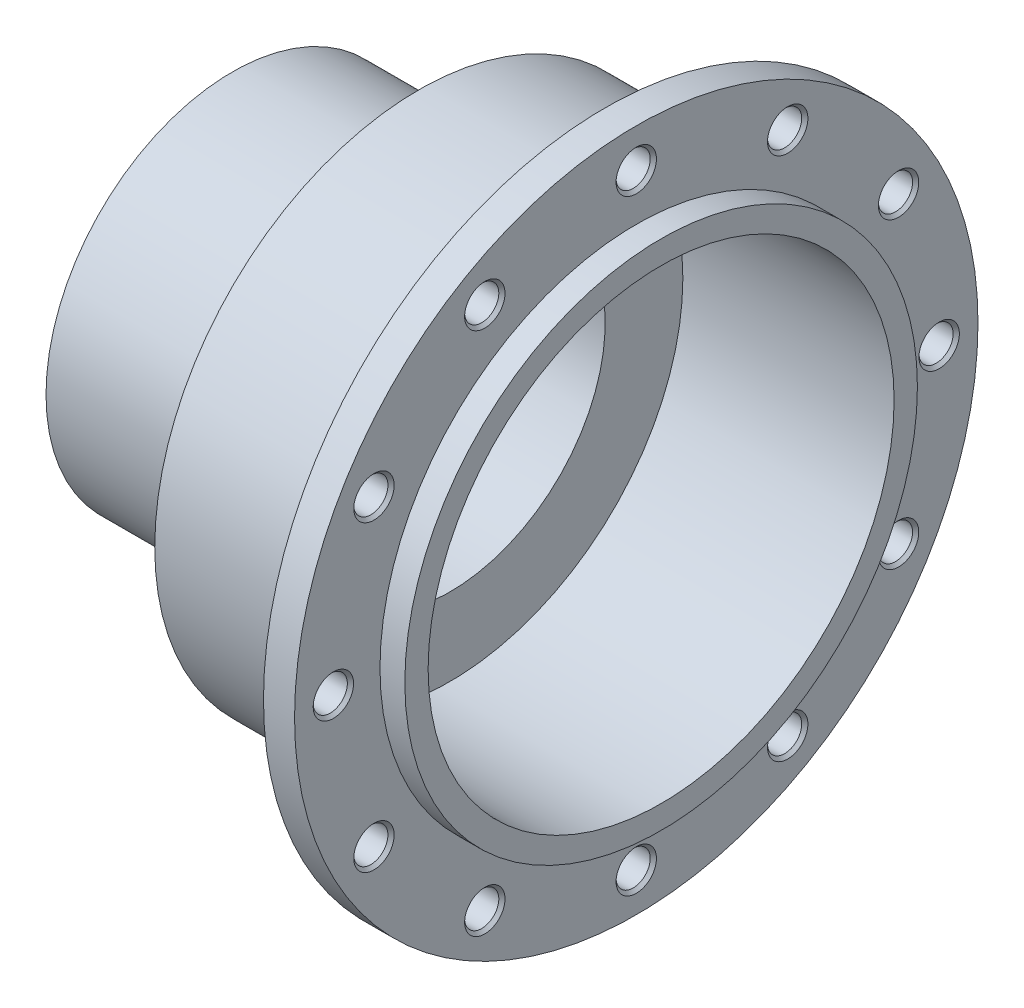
ISO-10303-21;
HEADER;
FILE_DESCRIPTION(('STEP AP214'),'2;1');
FILE_NAME('part.step','',(''),(''),'','','');
FILE_SCHEMA(('AUTOMOTIVE_DESIGN { 1 0 10303 214 1 1 1 1 }'));
ENDSEC;
DATA;
#1=APPLICATION_CONTEXT('core data for automotive mechanical design processes');
#2=APPLICATION_PROTOCOL_DEFINITION('international standard','automotive_design',2000,#1);
#3=PRODUCT_CONTEXT('',#1,'mechanical');
#4=PRODUCT('Part','Part','',(#3));
#5=PRODUCT_RELATED_PRODUCT_CATEGORY('part','',(#4));
#6=PRODUCT_DEFINITION_FORMATION('','',#4);
#7=PRODUCT_DEFINITION_CONTEXT('part definition',#1,'design');
#8=PRODUCT_DEFINITION('design','',#6,#7);
#9=PRODUCT_DEFINITION_SHAPE('','',#8);
#10=(LENGTH_UNIT() NAMED_UNIT(*) SI_UNIT(.MILLI.,.METRE.));
#11=(NAMED_UNIT(*) PLANE_ANGLE_UNIT() SI_UNIT($,.RADIAN.));
#12=(NAMED_UNIT(*) SI_UNIT($,.STERADIAN.) SOLID_ANGLE_UNIT());
#13=UNCERTAINTY_MEASURE_WITH_UNIT(LENGTH_MEASURE(1.E-05),#10,'distance_accuracy_value','');
#14=(GEOMETRIC_REPRESENTATION_CONTEXT(3) GLOBAL_UNCERTAINTY_ASSIGNED_CONTEXT((#13)) GLOBAL_UNIT_ASSIGNED_CONTEXT((#10,
#11,#12)) REPRESENTATION_CONTEXT('',''));
#15=CARTESIAN_POINT('',(0.,0.,0.));
#16=DIRECTION('',(0.,0.,1.));
#17=DIRECTION('',(1.,0.,0.));
#18=AXIS2_PLACEMENT_3D('',#15,#16,#17);
#19=CARTESIAN_POINT('',(10.,30.,0.));
#20=DIRECTION('',(-1.,0.,0.));
#21=DIRECTION('',(0.,0.,1.));
#22=AXIS2_PLACEMENT_3D('',#19,#20,#21);
#23=PLANE('',#22);
#24=CARTESIAN_POINT('',(10.,0.,0.));
#25=DIRECTION('',(-1.,0.,0.));
#26=DIRECTION('',(0.,0.,1.));
#27=AXIS2_PLACEMENT_3D('',#24,#25,#26);
#28=CIRCLE('',#27,14.5);
#29=CARTESIAN_POINT('',(10.,0.,14.5));
#30=VERTEX_POINT('',#29);
#31=EDGE_CURVE('E47',#30,#30,#28,.F.);
#32=ORIENTED_EDGE('',*,*,#31,.T.);
#33=EDGE_LOOP('',(#32));
#34=FACE_BOUND('',#33,.T.);
#35=CARTESIAN_POINT('',(10.,0.,0.));
#36=DIRECTION('',(-1.,0.,0.));
#37=DIRECTION('',(0.,0.,1.));
#38=AXIS2_PLACEMENT_3D('',#35,#36,#37);
#39=CIRCLE('',#38,12.75);
#40=CARTESIAN_POINT('',(10.,0.,12.75));
#41=VERTEX_POINT('',#40);
#42=EDGE_CURVE('E237',#41,#41,#39,.T.);
#43=ORIENTED_EDGE('',*,*,#42,.T.);
#44=EDGE_LOOP('',(#43));
#45=FACE_BOUND('',#44,.T.);
#46=ADVANCED_FACE('F39',(#34,#45),#23,.F.);
#47=CARTESIAN_POINT('',(130.,110.,0.));
#48=DIRECTION('',(-1.,0.,0.));
#49=DIRECTION('',(0.,0.,1.));
#50=AXIS2_PLACEMENT_3D('',#47,#48,#49);
#51=PLANE('',#50);
#52=CARTESIAN_POINT('',(130.,0.,0.));
#53=DIRECTION('',(-1.,0.,0.));
#54=DIRECTION('',(0.,0.,1.));
#55=AXIS2_PLACEMENT_3D('',#52,#53,#54);
#56=CIRCLE('',#55,110.);
#57=CARTESIAN_POINT('',(130.,0.,110.));
#58=VERTEX_POINT('',#57);
#59=EDGE_CURVE('E219',#58,#58,#56,.T.);
#60=ORIENTED_EDGE('',*,*,#59,.F.);
#61=EDGE_LOOP('',(#60));
#62=FACE_BOUND('',#61,.T.);
#63=CARTESIAN_POINT('',(130.,97.5,0.));
#64=DIRECTION('',(-1.,0.,0.));
#65=DIRECTION('',(0.,0.,1.));
#66=AXIS2_PLACEMENT_3D('',#63,#64,#65);
#67=CIRCLE('',#66,6.49999999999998);
#68=CARTESIAN_POINT('',(130.,97.5,6.49999999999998));
#69=VERTEX_POINT('',#68);
#70=EDGE_CURVE('E189',#69,#69,#67,.T.);
#71=ORIENTED_EDGE('',*,*,#70,.T.);
#72=EDGE_LOOP('',(#71));
#73=FACE_BOUND('',#72,.T.);
#74=CARTESIAN_POINT('',(130.,84.4374768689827,48.7500000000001));
#75=DIRECTION('',(-1.,0.,0.));
#76=DIRECTION('',(0.,0.,1.));
#77=AXIS2_PLACEMENT_3D('',#74,#75,#76);
#78=CIRCLE('',#77,6.50000000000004);
#79=CARTESIAN_POINT('',(130.,84.4374768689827,55.2500000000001));
#80=VERTEX_POINT('',#79);
#81=EDGE_CURVE('E177',#80,#80,#78,.T.);
#82=ORIENTED_EDGE('',*,*,#81,.T.);
#83=EDGE_LOOP('',(#82));
#84=FACE_BOUND('',#83,.T.);
#85=CARTESIAN_POINT('',(130.,48.7499999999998,84.4374768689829));
#86=DIRECTION('',(-1.,0.,0.));
#87=DIRECTION('',(0.,0.,1.));
#88=AXIS2_PLACEMENT_3D('',#85,#86,#87);
#89=CIRCLE('',#88,6.49999999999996);
#90=CARTESIAN_POINT('',(130.,48.7499999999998,90.9374768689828));
#91=VERTEX_POINT('',#90);
#92=EDGE_CURVE('E165',#91,#91,#89,.T.);
#93=ORIENTED_EDGE('',*,*,#92,.T.);
#94=EDGE_LOOP('',(#93));
#95=FACE_BOUND('',#94,.T.);
#96=CARTESIAN_POINT('',(130.,-3.40725592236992E-13,97.5));
#97=DIRECTION('',(-1.,0.,0.));
#98=DIRECTION('',(0.,0.,1.));
#99=AXIS2_PLACEMENT_3D('',#96,#97,#98);
#100=CIRCLE('',#99,6.49999999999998);
#101=CARTESIAN_POINT('',(130.,-3.40725592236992E-13,104.));
#102=VERTEX_POINT('',#101);
#103=EDGE_CURVE('E153',#102,#102,#100,.T.);
#104=ORIENTED_EDGE('',*,*,#103,.T.);
#105=EDGE_LOOP('',(#104));
#106=FACE_BOUND('',#105,.T.);
#107=CARTESIAN_POINT('',(130.,-48.7500000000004,84.4374768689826));
#108=DIRECTION('',(-1.,0.,0.));
#109=DIRECTION('',(0.,0.,1.));
#110=AXIS2_PLACEMENT_3D('',#107,#108,#109);
#111=CIRCLE('',#110,6.49999999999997);
#112=CARTESIAN_POINT('',(130.,-48.7500000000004,90.9374768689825));
#113=VERTEX_POINT('',#112);
#114=EDGE_CURVE('E141',#113,#113,#111,.T.);
#115=ORIENTED_EDGE('',*,*,#114,.T.);
#116=EDGE_LOOP('',(#115));
#117=FACE_BOUND('',#116,.T.);
#118=CARTESIAN_POINT('',(130.,-84.4374768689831,48.7499999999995));
#119=DIRECTION('',(-1.,0.,0.));
#120=DIRECTION('',(0.,0.,1.));
#121=AXIS2_PLACEMENT_3D('',#118,#119,#120);
#122=CIRCLE('',#121,6.49999999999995);
#123=CARTESIAN_POINT('',(130.,-84.4374768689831,55.2499999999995));
#124=VERTEX_POINT('',#123);
#125=EDGE_CURVE('E129',#124,#124,#122,.T.);
#126=ORIENTED_EDGE('',*,*,#125,.T.);
#127=EDGE_LOOP('',(#126));
#128=FACE_BOUND('',#127,.T.);
#129=CARTESIAN_POINT('',(130.,-97.5,0.));
#130=DIRECTION('',(-1.,0.,0.));
#131=DIRECTION('',(0.,0.,1.));
#132=AXIS2_PLACEMENT_3D('',#129,#130,#131);
#133=CIRCLE('',#132,6.49999999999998);
#134=CARTESIAN_POINT('',(130.,-97.5,6.49999999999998));
#135=VERTEX_POINT('',#134);
#136=EDGE_CURVE('E117',#135,#135,#133,.T.);
#137=ORIENTED_EDGE('',*,*,#136,.T.);
#138=EDGE_LOOP('',(#137));
#139=FACE_BOUND('',#138,.T.);
#140=CARTESIAN_POINT('',(130.,-84.4374768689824,-48.7500000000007));
#141=DIRECTION('',(-1.,0.,0.));
#142=DIRECTION('',(0.,0.,1.));
#143=AXIS2_PLACEMENT_3D('',#140,#141,#142);
#144=CIRCLE('',#143,6.49999999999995);
#145=CARTESIAN_POINT('',(130.,-84.4374768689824,-42.2500000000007));
#146=VERTEX_POINT('',#145);
#147=EDGE_CURVE('E105',#146,#146,#144,.T.);
#148=ORIENTED_EDGE('',*,*,#147,.T.);
#149=EDGE_LOOP('',(#148));
#150=FACE_BOUND('',#149,.T.);
#151=CARTESIAN_POINT('',(130.,-48.7499999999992,-84.4374768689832));
#152=DIRECTION('',(-1.,0.,0.));
#153=DIRECTION('',(0.,0.,1.));
#154=AXIS2_PLACEMENT_3D('',#151,#152,#153);
#155=CIRCLE('',#154,6.50000000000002);
#156=CARTESIAN_POINT('',(130.,-48.7499999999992,-77.9374768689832));
#157=VERTEX_POINT('',#156);
#158=EDGE_CURVE('E93',#157,#157,#155,.T.);
#159=ORIENTED_EDGE('',*,*,#158,.T.);
#160=EDGE_LOOP('',(#159));
#161=FACE_BOUND('',#160,.T.);
#162=CARTESIAN_POINT('',(130.,1.0215644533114E-12,-97.5));
#163=DIRECTION('',(-1.,0.,0.));
#164=DIRECTION('',(0.,0.,1.));
#165=AXIS2_PLACEMENT_3D('',#162,#163,#164);
#166=CIRCLE('',#165,6.49999999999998);
#167=CARTESIAN_POINT('',(130.,1.0215644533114E-12,-91.));
#168=VERTEX_POINT('',#167);
#169=EDGE_CURVE('E81',#168,#168,#166,.T.);
#170=ORIENTED_EDGE('',*,*,#169,.T.);
#171=EDGE_LOOP('',(#170));
#172=FACE_BOUND('',#171,.T.);
#173=CARTESIAN_POINT('',(130.,48.750000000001,-84.4374768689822));
#174=DIRECTION('',(-1.,0.,0.));
#175=DIRECTION('',(0.,0.,1.));
#176=AXIS2_PLACEMENT_3D('',#173,#174,#175);
#177=CIRCLE('',#176,6.49999999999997);
#178=CARTESIAN_POINT('',(130.,48.750000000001,-77.9374768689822));
#179=VERTEX_POINT('',#178);
#180=EDGE_CURVE('E69',#179,#179,#177,.T.);
#181=ORIENTED_EDGE('',*,*,#180,.T.);
#182=EDGE_LOOP('',(#181));
#183=FACE_BOUND('',#182,.T.);
#184=CARTESIAN_POINT('',(130.,84.4374768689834,-48.7499999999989));
#185=DIRECTION('',(-1.,0.,0.));
#186=DIRECTION('',(0.,0.,1.));
#187=AXIS2_PLACEMENT_3D('',#184,#185,#186);
#188=CIRCLE('',#187,6.50000000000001);
#189=CARTESIAN_POINT('',(130.,84.4374768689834,-42.2499999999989));
#190=VERTEX_POINT('',#189);
#191=EDGE_CURVE('E55',#190,#190,#188,.T.);
#192=ORIENTED_EDGE('',*,*,#191,.T.);
#193=EDGE_LOOP('',(#192));
#194=FACE_BOUND('',#193,.T.);
#195=CARTESIAN_POINT('',(130.,0.,0.));
#196=DIRECTION('',(-1.,0.,0.));
#197=DIRECTION('',(0.,0.,1.));
#198=AXIS2_PLACEMENT_3D('',#195,#196,#197);
#199=CIRCLE('',#198,82.5);
#200=CARTESIAN_POINT('',(130.,0.,82.5));
#201=VERTEX_POINT('',#200);
#202=EDGE_CURVE('E51',#201,#201,#199,.F.);
#203=ORIENTED_EDGE('',*,*,#202,.F.);
#204=EDGE_LOOP('',(#203));
#205=FACE_BOUND('',#204,.T.);
#206=ADVANCED_FACE('F269',(#62,#73,#84,#95,#106,#117,#128,#139,#150,#161,#172,#183,#194,#205),
#51,.F.);
#207=CARTESIAN_POINT('',(0.,0.,0.));
#208=DIRECTION('',(-1.,0.,0.));
#209=DIRECTION('',(0.,0.,1.));
#210=AXIS2_PLACEMENT_3D('',#207,#208,#209);
#211=CYLINDRICAL_SURFACE('',#210,12.75);
#212=ORIENTED_EDGE('',*,*,#42,.F.);
#213=EDGE_LOOP('',(#212));
#214=FACE_BOUND('',#213,.T.);
#215=CARTESIAN_POINT('',(0.,0.,0.));
#216=DIRECTION('',(-1.,0.,0.));
#217=DIRECTION('',(0.,0.,1.));
#218=AXIS2_PLACEMENT_3D('',#215,#216,#217);
#219=CIRCLE('',#218,12.75);
#220=CARTESIAN_POINT('',(0.,0.,12.75));
#221=VERTEX_POINT('',#220);
#222=EDGE_CURVE('E201',#221,#221,#219,.T.);
#223=ORIENTED_EDGE('',*,*,#222,.T.);
#224=EDGE_LOOP('',(#223));
#225=FACE_BOUND('',#224,.T.);
#226=ADVANCED_FACE('F276',(#214,#225),#211,.F.);
#227=CARTESIAN_POINT('',(0.,12.75,0.));
#228=DIRECTION('',(1.,0.,0.));
#229=DIRECTION('',(0.,0.,-1.));
#230=AXIS2_PLACEMENT_3D('',#227,#228,#229);
#231=PLANE('',#230);
#232=ORIENTED_EDGE('',*,*,#222,.F.);
#233=EDGE_LOOP('',(#232));
#234=FACE_BOUND('',#233,.T.);
#235=CARTESIAN_POINT('',(0.,0.,0.));
#236=DIRECTION('',(-1.,0.,0.));
#237=DIRECTION('',(0.,0.,1.));
#238=AXIS2_PLACEMENT_3D('',#235,#236,#237);
#239=CIRCLE('',#238,60.);
#240=CARTESIAN_POINT('',(0.,0.,60.));
#241=VERTEX_POINT('',#240);
#242=EDGE_CURVE('E204',#241,#241,#239,.T.);
#243=ORIENTED_EDGE('',*,*,#242,.T.);
#244=EDGE_LOOP('',(#243));
#245=FACE_BOUND('',#244,.T.);
#246=ADVANCED_FACE('F333',(#234,#245),#231,.F.);
#247=CARTESIAN_POINT('',(0.,0.,0.));
#248=DIRECTION('',(-1.,0.,0.));
#249=DIRECTION('',(0.,0.,1.));
#250=AXIS2_PLACEMENT_3D('',#247,#248,#249);
#251=CYLINDRICAL_SURFACE('',#250,60.);
#252=ORIENTED_EDGE('',*,*,#242,.F.);
#253=EDGE_LOOP('',(#252));
#254=FACE_BOUND('',#253,.T.);
#255=CARTESIAN_POINT('',(60.,0.,0.));
#256=DIRECTION('',(-1.,0.,0.));
#257=DIRECTION('',(0.,0.,1.));
#258=AXIS2_PLACEMENT_3D('',#255,#256,#257);
#259=CIRCLE('',#258,60.);
#260=CARTESIAN_POINT('',(60.,0.,60.));
#261=VERTEX_POINT('',#260);
#262=EDGE_CURVE('E207',#261,#261,#259,.T.);
#263=ORIENTED_EDGE('',*,*,#262,.T.);
#264=EDGE_LOOP('',(#263));
#265=FACE_BOUND('',#264,.T.);
#266=ADVANCED_FACE('F329',(#254,#265),#251,.T.);
#267=CARTESIAN_POINT('',(60.,60.,0.));
#268=DIRECTION('',(1.,0.,0.));
#269=DIRECTION('',(0.,0.,-1.));
#270=AXIS2_PLACEMENT_3D('',#267,#268,#269);
#271=PLANE('',#270);
#272=ORIENTED_EDGE('',*,*,#262,.F.);
#273=EDGE_LOOP('',(#272));
#274=FACE_BOUND('',#273,.T.);
#275=CARTESIAN_POINT('',(60.,0.,0.));
#276=DIRECTION('',(-1.,0.,0.));
#277=DIRECTION('',(0.,0.,1.));
#278=AXIS2_PLACEMENT_3D('',#275,#276,#277);
#279=CIRCLE('',#278,85.);
#280=CARTESIAN_POINT('',(60.,0.,85.));
#281=VERTEX_POINT('',#280);
#282=EDGE_CURVE('E210',#281,#281,#279,.T.);
#283=ORIENTED_EDGE('',*,*,#282,.T.);
#284=EDGE_LOOP('',(#283));
#285=FACE_BOUND('',#284,.T.);
#286=ADVANCED_FACE('F325',(#274,#285),#271,.F.);
#287=CARTESIAN_POINT('',(0.,0.,0.));
#288=DIRECTION('',(-1.,0.,0.));
#289=DIRECTION('',(0.,0.,1.));
#290=AXIS2_PLACEMENT_3D('',#287,#288,#289);
#291=CYLINDRICAL_SURFACE('',#290,85.);
#292=ORIENTED_EDGE('',*,*,#282,.F.);
#293=EDGE_LOOP('',(#292));
#294=FACE_BOUND('',#293,.T.);
#295=CARTESIAN_POINT('',(120.,0.,0.));
#296=DIRECTION('',(-1.,0.,0.));
#297=DIRECTION('',(0.,0.,1.));
#298=AXIS2_PLACEMENT_3D('',#295,#296,#297);
#299=CIRCLE('',#298,85.);
#300=CARTESIAN_POINT('',(120.,0.,85.));
#301=VERTEX_POINT('',#300);
#302=EDGE_CURVE('E213',#301,#301,#299,.T.);
#303=ORIENTED_EDGE('',*,*,#302,.T.);
#304=EDGE_LOOP('',(#303));
#305=FACE_BOUND('',#304,.T.);
#306=ADVANCED_FACE('F321',(#294,#305),#291,.T.);
#307=CARTESIAN_POINT('',(120.,85.,0.));
#308=DIRECTION('',(1.,0.,0.));
#309=DIRECTION('',(0.,0.,-1.));
#310=AXIS2_PLACEMENT_3D('',#307,#308,#309);
#311=PLANE('',#310);
#312=CARTESIAN_POINT('',(120.,84.4374768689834,-48.7499999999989));
#313=DIRECTION('',(1.,0.,0.));
#314=DIRECTION('',(0.,0.,-1.));
#315=AXIS2_PLACEMENT_3D('',#312,#313,#314);
#316=CIRCLE('',#315,6.50000000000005);
#317=CARTESIAN_POINT('',(120.,84.4374768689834,-55.249999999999));
#318=VERTEX_POINT('',#317);
#319=EDGE_CURVE('E60',#318,#318,#316,.T.);
#320=ORIENTED_EDGE('',*,*,#319,.T.);
#321=EDGE_LOOP('',(#320));
#322=FACE_BOUND('',#321,.T.);
#323=CARTESIAN_POINT('',(120.,48.750000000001,-84.4374768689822));
#324=DIRECTION('',(1.,0.,0.));
#325=DIRECTION('',(0.,0.,-1.));
#326=AXIS2_PLACEMENT_3D('',#323,#324,#325);
#327=CIRCLE('',#326,6.50000000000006);
#328=CARTESIAN_POINT('',(120.,48.750000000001,-90.9374768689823));
#329=VERTEX_POINT('',#328);
#330=EDGE_CURVE('E72',#329,#329,#327,.T.);
#331=ORIENTED_EDGE('',*,*,#330,.T.);
#332=EDGE_LOOP('',(#331));
#333=FACE_BOUND('',#332,.T.);
#334=CARTESIAN_POINT('',(120.,1.0215644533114E-12,-97.5));
#335=DIRECTION('',(1.,0.,0.));
#336=DIRECTION('',(0.,0.,-1.));
#337=AXIS2_PLACEMENT_3D('',#334,#335,#336);
#338=CIRCLE('',#337,6.49999999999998);
#339=CARTESIAN_POINT('',(120.,1.0215644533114E-12,-104.));
#340=VERTEX_POINT('',#339);
#341=EDGE_CURVE('E84',#340,#340,#338,.T.);
#342=ORIENTED_EDGE('',*,*,#341,.T.);
#343=EDGE_LOOP('',(#342));
#344=FACE_BOUND('',#343,.T.);
#345=CARTESIAN_POINT('',(120.,-48.7499999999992,-84.4374768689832));
#346=DIRECTION('',(1.,0.,0.));
#347=DIRECTION('',(0.,0.,-1.));
#348=AXIS2_PLACEMENT_3D('',#345,#346,#347);
#349=CIRCLE('',#348,6.50000000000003);
#350=CARTESIAN_POINT('',(120.,-48.7499999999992,-90.9374768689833));
#351=VERTEX_POINT('',#350);
#352=EDGE_CURVE('E96',#351,#351,#349,.T.);
#353=ORIENTED_EDGE('',*,*,#352,.T.);
#354=EDGE_LOOP('',(#353));
#355=FACE_BOUND('',#354,.T.);
#356=CARTESIAN_POINT('',(120.,-84.4374768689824,-48.7500000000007));
#357=DIRECTION('',(1.,0.,0.));
#358=DIRECTION('',(0.,0.,-1.));
#359=AXIS2_PLACEMENT_3D('',#356,#357,#358);
#360=CIRCLE('',#359,6.49999999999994);
#361=CARTESIAN_POINT('',(120.,-84.4374768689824,-55.2500000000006));
#362=VERTEX_POINT('',#361);
#363=EDGE_CURVE('E108',#362,#362,#360,.T.);
#364=ORIENTED_EDGE('',*,*,#363,.T.);
#365=EDGE_LOOP('',(#364));
#366=FACE_BOUND('',#365,.T.);
#367=CARTESIAN_POINT('',(120.,-97.5,0.));
#368=DIRECTION('',(1.,0.,0.));
#369=DIRECTION('',(0.,0.,-1.));
#370=AXIS2_PLACEMENT_3D('',#367,#368,#369);
#371=CIRCLE('',#370,6.49999999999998);
#372=CARTESIAN_POINT('',(120.,-97.5,-6.49999999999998));
#373=VERTEX_POINT('',#372);
#374=EDGE_CURVE('E120',#373,#373,#371,.T.);
#375=ORIENTED_EDGE('',*,*,#374,.T.);
#376=EDGE_LOOP('',(#375));
#377=FACE_BOUND('',#376,.T.);
#378=CARTESIAN_POINT('',(120.,-84.4374768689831,48.7499999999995));
#379=DIRECTION('',(1.,0.,0.));
#380=DIRECTION('',(0.,0.,-1.));
#381=AXIS2_PLACEMENT_3D('',#378,#379,#380);
#382=CIRCLE('',#381,6.49999999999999);
#383=CARTESIAN_POINT('',(120.,-84.4374768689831,42.2499999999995));
#384=VERTEX_POINT('',#383);
#385=EDGE_CURVE('E132',#384,#384,#382,.T.);
#386=ORIENTED_EDGE('',*,*,#385,.T.);
#387=EDGE_LOOP('',(#386));
#388=FACE_BOUND('',#387,.T.);
#389=CARTESIAN_POINT('',(120.,-48.7500000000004,84.4374768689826));
#390=DIRECTION('',(1.,0.,0.));
#391=DIRECTION('',(0.,0.,-1.));
#392=AXIS2_PLACEMENT_3D('',#389,#390,#391);
#393=CIRCLE('',#392,6.49999999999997);
#394=CARTESIAN_POINT('',(120.,-48.7500000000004,77.9374768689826));
#395=VERTEX_POINT('',#394);
#396=EDGE_CURVE('E144',#395,#395,#393,.T.);
#397=ORIENTED_EDGE('',*,*,#396,.T.);
#398=EDGE_LOOP('',(#397));
#399=FACE_BOUND('',#398,.T.);
#400=CARTESIAN_POINT('',(120.,-3.40725592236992E-13,97.5));
#401=DIRECTION('',(1.,0.,0.));
#402=DIRECTION('',(0.,0.,-1.));
#403=AXIS2_PLACEMENT_3D('',#400,#401,#402);
#404=CIRCLE('',#403,6.49999999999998);
#405=CARTESIAN_POINT('',(120.,-3.40725592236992E-13,91.));
#406=VERTEX_POINT('',#405);
#407=EDGE_CURVE('E156',#406,#406,#404,.T.);
#408=ORIENTED_EDGE('',*,*,#407,.T.);
#409=EDGE_LOOP('',(#408));
#410=FACE_BOUND('',#409,.T.);
#411=CARTESIAN_POINT('',(120.,48.7499999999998,84.4374768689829));
#412=DIRECTION('',(1.,0.,0.));
#413=DIRECTION('',(0.,0.,-1.));
#414=AXIS2_PLACEMENT_3D('',#411,#412,#413);
#415=CIRCLE('',#414,6.49999999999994);
#416=CARTESIAN_POINT('',(120.,48.7499999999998,77.9374768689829));
#417=VERTEX_POINT('',#416);
#418=EDGE_CURVE('E168',#417,#417,#415,.T.);
#419=ORIENTED_EDGE('',*,*,#418,.T.);
#420=EDGE_LOOP('',(#419));
#421=FACE_BOUND('',#420,.T.);
#422=CARTESIAN_POINT('',(120.,84.4374768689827,48.7500000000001));
#423=DIRECTION('',(1.,0.,0.));
#424=DIRECTION('',(0.,0.,-1.));
#425=AXIS2_PLACEMENT_3D('',#422,#423,#424);
#426=CIRCLE('',#425,6.49999999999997);
#427=CARTESIAN_POINT('',(120.,84.4374768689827,42.2500000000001));
#428=VERTEX_POINT('',#427);
#429=EDGE_CURVE('E180',#428,#428,#426,.T.);
#430=ORIENTED_EDGE('',*,*,#429,.T.);
#431=EDGE_LOOP('',(#430));
#432=FACE_BOUND('',#431,.T.);
#433=CARTESIAN_POINT('',(120.,97.5,0.));
#434=DIRECTION('',(1.,0.,0.));
#435=DIRECTION('',(0.,0.,-1.));
#436=AXIS2_PLACEMENT_3D('',#433,#434,#435);
#437=CIRCLE('',#436,6.49999999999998);
#438=CARTESIAN_POINT('',(120.,97.5,-6.49999999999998));
#439=VERTEX_POINT('',#438);
#440=EDGE_CURVE('E192',#439,#439,#437,.T.);
#441=ORIENTED_EDGE('',*,*,#440,.T.);
#442=EDGE_LOOP('',(#441));
#443=FACE_BOUND('',#442,.T.);
#444=ORIENTED_EDGE('',*,*,#302,.F.);
#445=EDGE_LOOP('',(#444));
#446=FACE_BOUND('',#445,.T.);
#447=CARTESIAN_POINT('',(120.,0.,0.));
#448=DIRECTION('',(-1.,0.,0.));
#449=DIRECTION('',(0.,0.,1.));
#450=AXIS2_PLACEMENT_3D('',#447,#448,#449);
#451=CIRCLE('',#450,110.);
#452=CARTESIAN_POINT('',(120.,0.,110.));
#453=VERTEX_POINT('',#452);
#454=EDGE_CURVE('E216',#453,#453,#451,.T.);
#455=ORIENTED_EDGE('',*,*,#454,.T.);
#456=EDGE_LOOP('',(#455));
#457=FACE_BOUND('',#456,.T.);
#458=ADVANCED_FACE('F317',(#322,#333,#344,#355,#366,#377,#388,#399,#410,#421,#432,#443,#446,
#457),#311,.F.);
#459=CARTESIAN_POINT('',(0.,0.,0.));
#460=DIRECTION('',(-1.,0.,0.));
#461=DIRECTION('',(0.,0.,1.));
#462=AXIS2_PLACEMENT_3D('',#459,#460,#461);
#463=CYLINDRICAL_SURFACE('',#462,110.);
#464=ORIENTED_EDGE('',*,*,#454,.F.);
#465=EDGE_LOOP('',(#464));
#466=FACE_BOUND('',#465,.T.);
#467=ORIENTED_EDGE('',*,*,#59,.T.);
#468=EDGE_LOOP('',(#467));
#469=FACE_BOUND('',#468,.T.);
#470=ADVANCED_FACE('F312',(#466,#469),#463,.T.);
#471=CARTESIAN_POINT('',(0.,0.,0.));
#472=DIRECTION('',(-1.,0.,0.));
#473=DIRECTION('',(0.,0.,1.));
#474=AXIS2_PLACEMENT_3D('',#471,#472,#473);
#475=CYLINDRICAL_SURFACE('',#474,75.);
#476=CARTESIAN_POINT('',(70.,0.,0.));
#477=DIRECTION('',(-1.,0.,0.));
#478=DIRECTION('',(0.,0.,1.));
#479=AXIS2_PLACEMENT_3D('',#476,#477,#478);
#480=CIRCLE('',#479,75.);
#481=CARTESIAN_POINT('',(70.,0.,75.));
#482=VERTEX_POINT('',#481);
#483=EDGE_CURVE('E222',#482,#482,#480,.T.);
#484=ORIENTED_EDGE('',*,*,#483,.T.);
#485=EDGE_LOOP('',(#484));
#486=FACE_BOUND('',#485,.T.);
#487=CARTESIAN_POINT('',(138.,0.,0.));
#488=DIRECTION('',(1.,0.,0.));
#489=DIRECTION('',(0.,0.,-1.));
#490=AXIS2_PLACEMENT_3D('',#487,#488,#489);
#491=CIRCLE('',#490,75.);
#492=CARTESIAN_POINT('',(138.,0.,-75.));
#493=VERTEX_POINT('',#492);
#494=EDGE_CURVE('E243',#493,#493,#491,.T.);
#495=ORIENTED_EDGE('',*,*,#494,.T.);
#496=EDGE_LOOP('',(#495));
#497=FACE_BOUND('',#496,.T.);
#498=ADVANCED_FACE('F309',(#486,#497),#475,.F.);
#499=CARTESIAN_POINT('',(70.,75.,0.));
#500=DIRECTION('',(-1.,0.,0.));
#501=DIRECTION('',(0.,0.,1.));
#502=AXIS2_PLACEMENT_3D('',#499,#500,#501);
#503=PLANE('',#502);
#504=ORIENTED_EDGE('',*,*,#483,.F.);
#505=EDGE_LOOP('',(#504));
#506=FACE_BOUND('',#505,.T.);
#507=CARTESIAN_POINT('',(70.,0.,0.));
#508=DIRECTION('',(-1.,0.,0.));
#509=DIRECTION('',(0.,0.,1.));
#510=AXIS2_PLACEMENT_3D('',#507,#508,#509);
#511=CIRCLE('',#510,50.);
#512=CARTESIAN_POINT('',(70.,0.,50.));
#513=VERTEX_POINT('',#512);
#514=EDGE_CURVE('E225',#513,#513,#511,.T.);
#515=ORIENTED_EDGE('',*,*,#514,.T.);
#516=EDGE_LOOP('',(#515));
#517=FACE_BOUND('',#516,.T.);
#518=ADVANCED_FACE('F305',(#506,#517),#503,.F.);
#519=CARTESIAN_POINT('',(0.,0.,0.));
#520=DIRECTION('',(-1.,0.,0.));
#521=DIRECTION('',(0.,0.,1.));
#522=AXIS2_PLACEMENT_3D('',#519,#520,#521);
#523=CYLINDRICAL_SURFACE('',#522,50.);
#524=ORIENTED_EDGE('',*,*,#514,.F.);
#525=EDGE_LOOP('',(#524));
#526=FACE_BOUND('',#525,.T.);
#527=CARTESIAN_POINT('',(26.,0.,0.));
#528=DIRECTION('',(-1.,0.,0.));
#529=DIRECTION('',(0.,0.,1.));
#530=AXIS2_PLACEMENT_3D('',#527,#528,#529);
#531=CIRCLE('',#530,50.);
#532=CARTESIAN_POINT('',(26.,0.,50.));
#533=VERTEX_POINT('',#532);
#534=EDGE_CURVE('E228',#533,#533,#531,.T.);
#535=ORIENTED_EDGE('',*,*,#534,.T.);
#536=EDGE_LOOP('',(#535));
#537=FACE_BOUND('',#536,.T.);
#538=ADVANCED_FACE('F298',(#526,#537),#523,.F.);
#539=CARTESIAN_POINT('',(26.,30.,0.));
#540=DIRECTION('',(-1.,0.,0.));
#541=DIRECTION('',(0.,0.,1.));
#542=AXIS2_PLACEMENT_3D('',#539,#540,#541);
#543=PLANE('',#542);
#544=ORIENTED_EDGE('',*,*,#534,.F.);
#545=EDGE_LOOP('',(#544));
#546=FACE_BOUND('',#545,.T.);
#547=CARTESIAN_POINT('',(26.,0.,0.));
#548=DIRECTION('',(-1.,0.,0.));
#549=DIRECTION('',(0.,0.,1.));
#550=AXIS2_PLACEMENT_3D('',#547,#548,#549);
#551=CIRCLE('',#550,30.);
#552=CARTESIAN_POINT('',(26.,0.,30.));
#553=VERTEX_POINT('',#552);
#554=EDGE_CURVE('E231',#553,#553,#551,.T.);
#555=ORIENTED_EDGE('',*,*,#554,.T.);
#556=EDGE_LOOP('',(#555));
#557=FACE_BOUND('',#556,.T.);
#558=ADVANCED_FACE('F290',(#546,#557),#543,.F.);
#559=CARTESIAN_POINT('',(0.,0.,0.));
#560=DIRECTION('',(-1.,0.,0.));
#561=DIRECTION('',(0.,0.,1.));
#562=AXIS2_PLACEMENT_3D('',#559,#560,#561);
#563=CYLINDRICAL_SURFACE('',#562,30.);
#564=ORIENTED_EDGE('',*,*,#554,.F.);
#565=EDGE_LOOP('',(#564));
#566=FACE_BOUND('',#565,.T.);
#567=CARTESIAN_POINT('',(10.,0.,0.));
#568=DIRECTION('',(-1.,0.,0.));
#569=DIRECTION('',(0.,0.,1.));
#570=AXIS2_PLACEMENT_3D('',#567,#568,#569);
#571=CIRCLE('',#570,30.);
#572=CARTESIAN_POINT('',(10.,0.,30.));
#573=VERTEX_POINT('',#572);
#574=EDGE_CURVE('E234',#573,#573,#571,.T.);
#575=ORIENTED_EDGE('',*,*,#574,.T.);
#576=EDGE_LOOP('',(#575));
#577=FACE_BOUND('',#576,.T.);
#578=ADVANCED_FACE('F283',(#566,#577),#563,.F.);
#579=CARTESIAN_POINT('',(10.,0.,0.));
#580=DIRECTION('',(-1.,0.,0.));
#581=DIRECTION('',(0.,0.,1.));
#582=AXIS2_PLACEMENT_3D('',#579,#580,#581);
#583=CIRCLE('',#582,23.0000000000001);
#584=CARTESIAN_POINT('',(10.,0.,23.0000000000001));
#585=VERTEX_POINT('',#584);
#586=EDGE_CURVE('E10',#585,#585,#583,.T.);
#587=ORIENTED_EDGE('',*,*,#586,.T.);
#588=EDGE_LOOP('',(#587));
#589=FACE_BOUND('',#588,.T.);
#590=ORIENTED_EDGE('',*,*,#574,.F.);
#591=EDGE_LOOP('',(#590));
#592=FACE_BOUND('',#591,.T.);
#593=ADVANCED_FACE('F271',(#589,#592),#23,.F.);
#594=CARTESIAN_POINT('',(130.,97.5,0.));
#595=DIRECTION('',(-1.,0.,0.));
#596=DIRECTION('',(0.,0.,1.));
#597=AXIS2_PLACEMENT_3D('',#594,#595,#596);
#598=CYLINDRICAL_SURFACE('',#597,5.5);
#599=CARTESIAN_POINT('',(121.,97.5,0.));
#600=DIRECTION('',(1.,0.,0.));
#601=DIRECTION('',(0.,0.,-1.));
#602=AXIS2_PLACEMENT_3D('',#599,#600,#601);
#603=CIRCLE('',#602,5.5);
#604=CARTESIAN_POINT('',(121.,97.5,-5.5));
#605=VERTEX_POINT('',#604);
#606=EDGE_CURVE('E195',#605,#605,#603,.F.);
#607=ORIENTED_EDGE('',*,*,#606,.T.);
#608=EDGE_LOOP('',(#607));
#609=FACE_BOUND('',#608,.T.);
#610=CARTESIAN_POINT('',(129.,97.5,0.));
#611=DIRECTION('',(-1.,0.,0.));
#612=DIRECTION('',(0.,0.,1.));
#613=AXIS2_PLACEMENT_3D('',#610,#611,#612);
#614=CIRCLE('',#613,5.5);
#615=CARTESIAN_POINT('',(129.,97.5,5.5));
#616=VERTEX_POINT('',#615);
#617=EDGE_CURVE('E198',#616,#616,#614,.F.);
#618=ORIENTED_EDGE('',*,*,#617,.T.);
#619=EDGE_LOOP('',(#618));
#620=FACE_BOUND('',#619,.T.);
#621=ADVANCED_FACE('F282',(#609,#620),#598,.F.);
#622=CARTESIAN_POINT('',(121.,97.5,0.));
#623=DIRECTION('',(-1.,0.,0.));
#624=DIRECTION('',(0.,0.,1.));
#625=AXIS2_PLACEMENT_3D('',#622,#623,#624);
#626=CONICAL_SURFACE('',#625,5.5,0.78539816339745);
#627=ORIENTED_EDGE('',*,*,#440,.F.);
#628=EDGE_LOOP('',(#627));
#629=FACE_BOUND('',#628,.T.);
#630=ORIENTED_EDGE('',*,*,#606,.F.);
#631=EDGE_LOOP('',(#630));
#632=FACE_BOUND('',#631,.T.);
#633=ADVANCED_FACE('F287',(#629,#632),#626,.F.);
#634=CARTESIAN_POINT('',(130.,97.5,0.));
#635=DIRECTION('',(1.,0.,0.));
#636=DIRECTION('',(0.,0.,-1.));
#637=AXIS2_PLACEMENT_3D('',#634,#635,#636);
#638=CONICAL_SURFACE('',#637,6.49999999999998,0.78539816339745);
#639=ORIENTED_EDGE('',*,*,#617,.F.);
#640=EDGE_LOOP('',(#639));
#641=FACE_BOUND('',#640,.T.);
#642=ORIENTED_EDGE('',*,*,#70,.F.);
#643=EDGE_LOOP('',(#642));
#644=FACE_BOUND('',#643,.T.);
#645=ADVANCED_FACE('F347',(#641,#644),#638,.F.);
#646=CARTESIAN_POINT('',(130.,84.4374768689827,48.7500000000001));
#647=DIRECTION('',(-1.,0.,0.));
#648=DIRECTION('',(0.,0.,1.));
#649=AXIS2_PLACEMENT_3D('',#646,#647,#648);
#650=CYLINDRICAL_SURFACE('',#649,5.5);
#651=CARTESIAN_POINT('',(121.,84.4374768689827,48.7500000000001));
#652=DIRECTION('',(1.,0.,0.));
#653=DIRECTION('',(0.,0.,-1.));
#654=AXIS2_PLACEMENT_3D('',#651,#652,#653);
#655=CIRCLE('',#654,5.5);
#656=CARTESIAN_POINT('',(121.,84.4374768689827,43.2500000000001));
#657=VERTEX_POINT('',#656);
#658=EDGE_CURVE('E183',#657,#657,#655,.F.);
#659=ORIENTED_EDGE('',*,*,#658,.T.);
#660=EDGE_LOOP('',(#659));
#661=FACE_BOUND('',#660,.T.);
#662=CARTESIAN_POINT('',(129.,84.4374768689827,48.7500000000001));
#663=DIRECTION('',(-1.,0.,0.));
#664=DIRECTION('',(0.,0.,1.));
#665=AXIS2_PLACEMENT_3D('',#662,#663,#664);
#666=CIRCLE('',#665,5.5);
#667=CARTESIAN_POINT('',(129.,84.4374768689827,54.2500000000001));
#668=VERTEX_POINT('',#667);
#669=EDGE_CURVE('E186',#668,#668,#666,.F.);
#670=ORIENTED_EDGE('',*,*,#669,.T.);
#671=EDGE_LOOP('',(#670));
#672=FACE_BOUND('',#671,.T.);
#673=ADVANCED_FACE('F354',(#661,#672),#650,.F.);
#674=CARTESIAN_POINT('',(130.,84.4374768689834,-48.7499999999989));
#675=DIRECTION('',(-1.,0.,0.));
#676=DIRECTION('',(0.,0.,1.));
#677=AXIS2_PLACEMENT_3D('',#674,#675,#676);
#678=CYLINDRICAL_SURFACE('',#677,5.5);
#679=CARTESIAN_POINT('',(121.,84.4374768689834,-48.7499999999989));
#680=DIRECTION('',(1.,0.,0.));
#681=DIRECTION('',(0.,0.,-1.));
#682=AXIS2_PLACEMENT_3D('',#679,#680,#681);
#683=CIRCLE('',#682,5.5);
#684=CARTESIAN_POINT('',(121.,84.4374768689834,-54.2499999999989));
#685=VERTEX_POINT('',#684);
#686=EDGE_CURVE('E63',#685,#685,#683,.F.);
#687=ORIENTED_EDGE('',*,*,#686,.T.);
#688=EDGE_LOOP('',(#687));
#689=FACE_BOUND('',#688,.T.);
#690=CARTESIAN_POINT('',(129.,84.4374768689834,-48.7499999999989));
#691=DIRECTION('',(-1.,0.,0.));
#692=DIRECTION('',(0.,0.,1.));
#693=AXIS2_PLACEMENT_3D('',#690,#691,#692);
#694=CIRCLE('',#693,5.5);
#695=CARTESIAN_POINT('',(129.,84.4374768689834,-43.2499999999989));
#696=VERTEX_POINT('',#695);
#697=EDGE_CURVE('E66',#696,#696,#694,.F.);
#698=ORIENTED_EDGE('',*,*,#697,.T.);
#699=EDGE_LOOP('',(#698));
#700=FACE_BOUND('',#699,.T.);
#701=ADVANCED_FACE('F538',(#689,#700),#678,.F.);
#702=CARTESIAN_POINT('',(130.,48.750000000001,-84.4374768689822));
#703=DIRECTION('',(-1.,0.,0.));
#704=DIRECTION('',(0.,0.,1.));
#705=AXIS2_PLACEMENT_3D('',#702,#703,#704);
#706=CYLINDRICAL_SURFACE('',#705,5.5);
#707=CARTESIAN_POINT('',(121.,48.750000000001,-84.4374768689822));
#708=DIRECTION('',(1.,0.,0.));
#709=DIRECTION('',(0.,0.,-1.));
#710=AXIS2_PLACEMENT_3D('',#707,#708,#709);
#711=CIRCLE('',#710,5.5);
#712=CARTESIAN_POINT('',(121.,48.750000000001,-89.9374768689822));
#713=VERTEX_POINT('',#712);
#714=EDGE_CURVE('E75',#713,#713,#711,.F.);
#715=ORIENTED_EDGE('',*,*,#714,.T.);
#716=EDGE_LOOP('',(#715));
#717=FACE_BOUND('',#716,.T.);
#718=CARTESIAN_POINT('',(129.,48.750000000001,-84.4374768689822));
#719=DIRECTION('',(-1.,0.,0.));
#720=DIRECTION('',(0.,0.,1.));
#721=AXIS2_PLACEMENT_3D('',#718,#719,#720);
#722=CIRCLE('',#721,5.5);
#723=CARTESIAN_POINT('',(129.,48.750000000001,-78.9374768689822));
#724=VERTEX_POINT('',#723);
#725=EDGE_CURVE('E78',#724,#724,#722,.F.);
#726=ORIENTED_EDGE('',*,*,#725,.T.);
#727=EDGE_LOOP('',(#726));
#728=FACE_BOUND('',#727,.T.);
#729=ADVANCED_FACE('F534',(#717,#728),#706,.F.);
#730=CARTESIAN_POINT('',(130.,1.0215644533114E-12,-97.5));
#731=DIRECTION('',(-1.,0.,0.));
#732=DIRECTION('',(0.,0.,1.));
#733=AXIS2_PLACEMENT_3D('',#730,#731,#732);
#734=CYLINDRICAL_SURFACE('',#733,5.5);
#735=CARTESIAN_POINT('',(121.,1.0215644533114E-12,-97.5));
#736=DIRECTION('',(1.,0.,0.));
#737=DIRECTION('',(0.,0.,-1.));
#738=AXIS2_PLACEMENT_3D('',#735,#736,#737);
#739=CIRCLE('',#738,5.5);
#740=CARTESIAN_POINT('',(121.,1.0215644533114E-12,-103.));
#741=VERTEX_POINT('',#740);
#742=EDGE_CURVE('E87',#741,#741,#739,.F.);
#743=ORIENTED_EDGE('',*,*,#742,.T.);
#744=EDGE_LOOP('',(#743));
#745=FACE_BOUND('',#744,.T.);
#746=CARTESIAN_POINT('',(129.,1.0215644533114E-12,-97.5));
#747=DIRECTION('',(-1.,0.,0.));
#748=DIRECTION('',(0.,0.,1.));
#749=AXIS2_PLACEMENT_3D('',#746,#747,#748);
#750=CIRCLE('',#749,5.5);
#751=CARTESIAN_POINT('',(129.,1.0215644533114E-12,-92.));
#752=VERTEX_POINT('',#751);
#753=EDGE_CURVE('E90',#752,#752,#750,.F.);
#754=ORIENTED_EDGE('',*,*,#753,.T.);
#755=EDGE_LOOP('',(#754));
#756=FACE_BOUND('',#755,.T.);
#757=ADVANCED_FACE('F537',(#745,#756),#734,.F.);
#758=CARTESIAN_POINT('',(130.,-48.7499999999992,-84.4374768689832));
#759=DIRECTION('',(-1.,0.,0.));
#760=DIRECTION('',(0.,0.,1.));
#761=AXIS2_PLACEMENT_3D('',#758,#759,#760);
#762=CYLINDRICAL_SURFACE('',#761,5.5);
#763=CARTESIAN_POINT('',(121.,-48.7499999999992,-84.4374768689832));
#764=DIRECTION('',(1.,0.,0.));
#765=DIRECTION('',(0.,0.,-1.));
#766=AXIS2_PLACEMENT_3D('',#763,#764,#765);
#767=CIRCLE('',#766,5.5);
#768=CARTESIAN_POINT('',(121.,-48.7499999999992,-89.9374768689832));
#769=VERTEX_POINT('',#768);
#770=EDGE_CURVE('E99',#769,#769,#767,.F.);
#771=ORIENTED_EDGE('',*,*,#770,.T.);
#772=EDGE_LOOP('',(#771));
#773=FACE_BOUND('',#772,.T.);
#774=CARTESIAN_POINT('',(129.,-48.7499999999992,-84.4374768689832));
#775=DIRECTION('',(-1.,0.,0.));
#776=DIRECTION('',(0.,0.,1.));
#777=AXIS2_PLACEMENT_3D('',#774,#775,#776);
#778=CIRCLE('',#777,5.5);
#779=CARTESIAN_POINT('',(129.,-48.7499999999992,-78.9374768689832));
#780=VERTEX_POINT('',#779);
#781=EDGE_CURVE('E102',#780,#780,#778,.F.);
#782=ORIENTED_EDGE('',*,*,#781,.T.);
#783=EDGE_LOOP('',(#782));
#784=FACE_BOUND('',#783,.T.);
#785=ADVANCED_FACE('F565',(#773,#784),#762,.F.);
#786=CARTESIAN_POINT('',(130.,-84.4374768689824,-48.7500000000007));
#787=DIRECTION('',(-1.,0.,0.));
#788=DIRECTION('',(0.,0.,1.));
#789=AXIS2_PLACEMENT_3D('',#786,#787,#788);
#790=CYLINDRICAL_SURFACE('',#789,5.5);
#791=CARTESIAN_POINT('',(121.,-84.4374768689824,-48.7500000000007));
#792=DIRECTION('',(1.,0.,0.));
#793=DIRECTION('',(0.,0.,-1.));
#794=AXIS2_PLACEMENT_3D('',#791,#792,#793);
#795=CIRCLE('',#794,5.5);
#796=CARTESIAN_POINT('',(121.,-84.4374768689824,-54.2500000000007));
#797=VERTEX_POINT('',#796);
#798=EDGE_CURVE('E111',#797,#797,#795,.F.);
#799=ORIENTED_EDGE('',*,*,#798,.T.);
#800=EDGE_LOOP('',(#799));
#801=FACE_BOUND('',#800,.T.);
#802=CARTESIAN_POINT('',(129.,-84.4374768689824,-48.7500000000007));
#803=DIRECTION('',(-1.,0.,0.));
#804=DIRECTION('',(0.,0.,1.));
#805=AXIS2_PLACEMENT_3D('',#802,#803,#804);
#806=CIRCLE('',#805,5.5);
#807=CARTESIAN_POINT('',(129.,-84.4374768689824,-43.2500000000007));
#808=VERTEX_POINT('',#807);
#809=EDGE_CURVE('E114',#808,#808,#806,.F.);
#810=ORIENTED_EDGE('',*,*,#809,.T.);
#811=EDGE_LOOP('',(#810));
#812=FACE_BOUND('',#811,.T.);
#813=ADVANCED_FACE('F561',(#801,#812),#790,.F.);
#814=CARTESIAN_POINT('',(130.,-97.5,0.));
#815=DIRECTION('',(-1.,0.,0.));
#816=DIRECTION('',(0.,0.,1.));
#817=AXIS2_PLACEMENT_3D('',#814,#815,#816);
#818=CYLINDRICAL_SURFACE('',#817,5.5);
#819=CARTESIAN_POINT('',(121.,-97.5,0.));
#820=DIRECTION('',(1.,0.,0.));
#821=DIRECTION('',(0.,0.,-1.));
#822=AXIS2_PLACEMENT_3D('',#819,#820,#821);
#823=CIRCLE('',#822,5.5);
#824=CARTESIAN_POINT('',(121.,-97.5,-5.5));
#825=VERTEX_POINT('',#824);
#826=EDGE_CURVE('E123',#825,#825,#823,.F.);
#827=ORIENTED_EDGE('',*,*,#826,.T.);
#828=EDGE_LOOP('',(#827));
#829=FACE_BOUND('',#828,.T.);
#830=CARTESIAN_POINT('',(129.,-97.5,0.));
#831=DIRECTION('',(-1.,0.,0.));
#832=DIRECTION('',(0.,0.,1.));
#833=AXIS2_PLACEMENT_3D('',#830,#831,#832);
#834=CIRCLE('',#833,5.5);
#835=CARTESIAN_POINT('',(129.,-97.5,5.5));
#836=VERTEX_POINT('',#835);
#837=EDGE_CURVE('E126',#836,#836,#834,.F.);
#838=ORIENTED_EDGE('',*,*,#837,.T.);
#839=EDGE_LOOP('',(#838));
#840=FACE_BOUND('',#839,.T.);
#841=ADVANCED_FACE('F557',(#829,#840),#818,.F.);
#842=CARTESIAN_POINT('',(130.,-84.4374768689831,48.7499999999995));
#843=DIRECTION('',(-1.,0.,0.));
#844=DIRECTION('',(0.,0.,1.));
#845=AXIS2_PLACEMENT_3D('',#842,#843,#844);
#846=CYLINDRICAL_SURFACE('',#845,5.5);
#847=CARTESIAN_POINT('',(121.,-84.4374768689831,48.7499999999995));
#848=DIRECTION('',(1.,0.,0.));
#849=DIRECTION('',(0.,0.,-1.));
#850=AXIS2_PLACEMENT_3D('',#847,#848,#849);
#851=CIRCLE('',#850,5.5);
#852=CARTESIAN_POINT('',(121.,-84.4374768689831,43.2499999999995));
#853=VERTEX_POINT('',#852);
#854=EDGE_CURVE('E135',#853,#853,#851,.F.);
#855=ORIENTED_EDGE('',*,*,#854,.T.);
#856=EDGE_LOOP('',(#855));
#857=FACE_BOUND('',#856,.T.);
#858=CARTESIAN_POINT('',(129.,-84.4374768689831,48.7499999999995));
#859=DIRECTION('',(-1.,0.,0.));
#860=DIRECTION('',(0.,0.,1.));
#861=AXIS2_PLACEMENT_3D('',#858,#859,#860);
#862=CIRCLE('',#861,5.5);
#863=CARTESIAN_POINT('',(129.,-84.4374768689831,54.2499999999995));
#864=VERTEX_POINT('',#863);
#865=EDGE_CURVE('E138',#864,#864,#862,.F.);
#866=ORIENTED_EDGE('',*,*,#865,.T.);
#867=EDGE_LOOP('',(#866));
#868=FACE_BOUND('',#867,.T.);
#869=ADVANCED_FACE('F553',(#857,#868),#846,.F.);
#870=CARTESIAN_POINT('',(130.,-48.7500000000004,84.4374768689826));
#871=DIRECTION('',(-1.,0.,0.));
#872=DIRECTION('',(0.,0.,1.));
#873=AXIS2_PLACEMENT_3D('',#870,#871,#872);
#874=CYLINDRICAL_SURFACE('',#873,5.5);
#875=CARTESIAN_POINT('',(121.,-48.7500000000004,84.4374768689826));
#876=DIRECTION('',(1.,0.,0.));
#877=DIRECTION('',(0.,0.,-1.));
#878=AXIS2_PLACEMENT_3D('',#875,#876,#877);
#879=CIRCLE('',#878,5.5);
#880=CARTESIAN_POINT('',(121.,-48.7500000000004,78.9374768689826));
#881=VERTEX_POINT('',#880);
#882=EDGE_CURVE('E147',#881,#881,#879,.F.);
#883=ORIENTED_EDGE('',*,*,#882,.T.);
#884=EDGE_LOOP('',(#883));
#885=FACE_BOUND('',#884,.T.);
#886=CARTESIAN_POINT('',(129.,-48.7500000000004,84.4374768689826));
#887=DIRECTION('',(-1.,0.,0.));
#888=DIRECTION('',(0.,0.,1.));
#889=AXIS2_PLACEMENT_3D('',#886,#887,#888);
#890=CIRCLE('',#889,5.5);
#891=CARTESIAN_POINT('',(129.,-48.7500000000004,89.9374768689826));
#892=VERTEX_POINT('',#891);
#893=EDGE_CURVE('E150',#892,#892,#890,.F.);
#894=ORIENTED_EDGE('',*,*,#893,.T.);
#895=EDGE_LOOP('',(#894));
#896=FACE_BOUND('',#895,.T.);
#897=ADVANCED_FACE('F549',(#885,#896),#874,.F.);
#898=CARTESIAN_POINT('',(130.,-3.40725592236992E-13,97.5));
#899=DIRECTION('',(-1.,0.,0.));
#900=DIRECTION('',(0.,0.,1.));
#901=AXIS2_PLACEMENT_3D('',#898,#899,#900);
#902=CYLINDRICAL_SURFACE('',#901,5.5);
#903=CARTESIAN_POINT('',(121.,-3.40725592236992E-13,97.5));
#904=DIRECTION('',(1.,0.,0.));
#905=DIRECTION('',(0.,0.,-1.));
#906=AXIS2_PLACEMENT_3D('',#903,#904,#905);
#907=CIRCLE('',#906,5.5);
#908=CARTESIAN_POINT('',(121.,-3.40725592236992E-13,92.));
#909=VERTEX_POINT('',#908);
#910=EDGE_CURVE('E159',#909,#909,#907,.F.);
#911=ORIENTED_EDGE('',*,*,#910,.T.);
#912=EDGE_LOOP('',(#911));
#913=FACE_BOUND('',#912,.T.);
#914=CARTESIAN_POINT('',(129.,-3.40725592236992E-13,97.5));
#915=DIRECTION('',(-1.,0.,0.));
#916=DIRECTION('',(0.,0.,1.));
#917=AXIS2_PLACEMENT_3D('',#914,#915,#916);
#918=CIRCLE('',#917,5.5);
#919=CARTESIAN_POINT('',(129.,-3.40725592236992E-13,103.));
#920=VERTEX_POINT('',#919);
#921=EDGE_CURVE('E162',#920,#920,#918,.F.);
#922=ORIENTED_EDGE('',*,*,#921,.T.);
#923=EDGE_LOOP('',(#922));
#924=FACE_BOUND('',#923,.T.);
#925=ADVANCED_FACE('F545',(#913,#924),#902,.F.);
#926=CARTESIAN_POINT('',(130.,48.7499999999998,84.4374768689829));
#927=DIRECTION('',(-1.,0.,0.));
#928=DIRECTION('',(0.,0.,1.));
#929=AXIS2_PLACEMENT_3D('',#926,#927,#928);
#930=CYLINDRICAL_SURFACE('',#929,5.5);
#931=CARTESIAN_POINT('',(121.,48.7499999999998,84.4374768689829));
#932=DIRECTION('',(1.,0.,0.));
#933=DIRECTION('',(0.,0.,-1.));
#934=AXIS2_PLACEMENT_3D('',#931,#932,#933);
#935=CIRCLE('',#934,5.5);
#936=CARTESIAN_POINT('',(121.,48.7499999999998,78.9374768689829));
#937=VERTEX_POINT('',#936);
#938=EDGE_CURVE('E171',#937,#937,#935,.F.);
#939=ORIENTED_EDGE('',*,*,#938,.T.);
#940=EDGE_LOOP('',(#939));
#941=FACE_BOUND('',#940,.T.);
#942=CARTESIAN_POINT('',(129.,48.7499999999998,84.4374768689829));
#943=DIRECTION('',(-1.,0.,0.));
#944=DIRECTION('',(0.,0.,1.));
#945=AXIS2_PLACEMENT_3D('',#942,#943,#944);
#946=CIRCLE('',#945,5.5);
#947=CARTESIAN_POINT('',(129.,48.7499999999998,89.9374768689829));
#948=VERTEX_POINT('',#947);
#949=EDGE_CURVE('E174',#948,#948,#946,.F.);
#950=ORIENTED_EDGE('',*,*,#949,.T.);
#951=EDGE_LOOP('',(#950));
#952=FACE_BOUND('',#951,.T.);
#953=ADVANCED_FACE('F363',(#941,#952),#930,.F.);
#954=CARTESIAN_POINT('',(121.,84.4374768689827,48.7500000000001));
#955=DIRECTION('',(-1.,0.,0.));
#956=DIRECTION('',(0.,0.,1.));
#957=AXIS2_PLACEMENT_3D('',#954,#955,#956);
#958=CONICAL_SURFACE('',#957,5.5,0.785398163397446);
#959=ORIENTED_EDGE('',*,*,#429,.F.);
#960=EDGE_LOOP('',(#959));
#961=FACE_BOUND('',#960,.T.);
#962=ORIENTED_EDGE('',*,*,#658,.F.);
#963=EDGE_LOOP('',(#962));
#964=FACE_BOUND('',#963,.T.);
#965=ADVANCED_FACE('F356',(#961,#964),#958,.F.);
#966=CARTESIAN_POINT('',(130.,84.4374768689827,48.7500000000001));
#967=DIRECTION('',(1.,0.,0.));
#968=DIRECTION('',(0.,0.,-1.));
#969=AXIS2_PLACEMENT_3D('',#966,#967,#968);
#970=CONICAL_SURFACE('',#969,6.50000000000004,0.785398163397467);
#971=ORIENTED_EDGE('',*,*,#669,.F.);
#972=EDGE_LOOP('',(#971));
#973=FACE_BOUND('',#972,.T.);
#974=ORIENTED_EDGE('',*,*,#81,.F.);
#975=EDGE_LOOP('',(#974));
#976=FACE_BOUND('',#975,.T.);
#977=ADVANCED_FACE('F362',(#973,#976),#970,.F.);
#978=CARTESIAN_POINT('',(121.,48.7499999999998,84.4374768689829));
#979=DIRECTION('',(-1.,0.,0.));
#980=DIRECTION('',(0.,0.,1.));
#981=AXIS2_PLACEMENT_3D('',#978,#979,#980);
#982=CONICAL_SURFACE('',#981,5.5,0.78539816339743);
#983=ORIENTED_EDGE('',*,*,#418,.F.);
#984=EDGE_LOOP('',(#983));
#985=FACE_BOUND('',#984,.T.);
#986=ORIENTED_EDGE('',*,*,#938,.F.);
#987=EDGE_LOOP('',(#986));
#988=FACE_BOUND('',#987,.T.);
#989=ADVANCED_FACE('F370',(#985,#988),#982,.F.);
#990=CARTESIAN_POINT('',(130.,48.7499999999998,84.4374768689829));
#991=DIRECTION('',(1.,0.,0.));
#992=DIRECTION('',(0.,0.,-1.));
#993=AXIS2_PLACEMENT_3D('',#990,#991,#992);
#994=CONICAL_SURFACE('',#993,6.49999999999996,0.785398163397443);
#995=ORIENTED_EDGE('',*,*,#949,.F.);
#996=EDGE_LOOP('',(#995));
#997=FACE_BOUND('',#996,.T.);
#998=ORIENTED_EDGE('',*,*,#92,.F.);
#999=EDGE_LOOP('',(#998));
#1000=FACE_BOUND('',#999,.T.);
#1001=ADVANCED_FACE('F377',(#997,#1000),#994,.F.);
#1002=CARTESIAN_POINT('',(121.,-3.40725592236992E-13,97.5));
#1003=DIRECTION('',(-1.,0.,0.));
#1004=DIRECTION('',(0.,0.,1.));
#1005=AXIS2_PLACEMENT_3D('',#1002,#1003,#1004);
#1006=CONICAL_SURFACE('',#1005,5.5,0.78539816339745);
#1007=ORIENTED_EDGE('',*,*,#407,.F.);
#1008=EDGE_LOOP('',(#1007));
#1009=FACE_BOUND('',#1008,.T.);
#1010=ORIENTED_EDGE('',*,*,#910,.F.);
#1011=EDGE_LOOP('',(#1010));
#1012=FACE_BOUND('',#1011,.T.);
#1013=ADVANCED_FACE('F384',(#1009,#1012),#1006,.F.);
#1014=CARTESIAN_POINT('',(130.,-3.40725592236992E-13,97.5));
#1015=DIRECTION('',(1.,0.,0.));
#1016=DIRECTION('',(0.,0.,-1.));
#1017=AXIS2_PLACEMENT_3D('',#1014,#1015,#1016);
#1018=CONICAL_SURFACE('',#1017,6.49999999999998,0.78539816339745);
#1019=ORIENTED_EDGE('',*,*,#921,.F.);
#1020=EDGE_LOOP('',(#1019));
#1021=FACE_BOUND('',#1020,.T.);
#1022=ORIENTED_EDGE('',*,*,#103,.F.);
#1023=EDGE_LOOP('',(#1022));
#1024=FACE_BOUND('',#1023,.T.);
#1025=ADVANCED_FACE('F391',(#1021,#1024),#1018,.F.);
#1026=CARTESIAN_POINT('',(121.,-48.7500000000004,84.4374768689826));
#1027=DIRECTION('',(-1.,0.,0.));
#1028=DIRECTION('',(0.,0.,1.));
#1029=AXIS2_PLACEMENT_3D('',#1026,#1027,#1028);
#1030=CONICAL_SURFACE('',#1029,5.5,0.785398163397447);
#1031=ORIENTED_EDGE('',*,*,#396,.F.);
#1032=EDGE_LOOP('',(#1031));
#1033=FACE_BOUND('',#1032,.T.);
#1034=ORIENTED_EDGE('',*,*,#882,.F.);
#1035=EDGE_LOOP('',(#1034));
#1036=FACE_BOUND('',#1035,.T.);
#1037=ADVANCED_FACE('F398',(#1033,#1036),#1030,.F.);
#1038=CARTESIAN_POINT('',(130.,-48.7500000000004,84.4374768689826));
#1039=DIRECTION('',(1.,0.,0.));
#1040=DIRECTION('',(0.,0.,-1.));
#1041=AXIS2_PLACEMENT_3D('',#1038,#1039,#1040);
#1042=CONICAL_SURFACE('',#1041,6.49999999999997,0.785398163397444);
#1043=ORIENTED_EDGE('',*,*,#893,.F.);
#1044=EDGE_LOOP('',(#1043));
#1045=FACE_BOUND('',#1044,.T.);
#1046=ORIENTED_EDGE('',*,*,#114,.F.);
#1047=EDGE_LOOP('',(#1046));
#1048=FACE_BOUND('',#1047,.T.);
#1049=ADVANCED_FACE('F405',(#1045,#1048),#1042,.F.);
#1050=CARTESIAN_POINT('',(121.,-84.4374768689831,48.7499999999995));
#1051=DIRECTION('',(-1.,0.,0.));
#1052=DIRECTION('',(0.,0.,1.));
#1053=AXIS2_PLACEMENT_3D('',#1050,#1051,#1052);
#1054=CONICAL_SURFACE('',#1053,5.5,0.785398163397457);
#1055=ORIENTED_EDGE('',*,*,#385,.F.);
#1056=EDGE_LOOP('',(#1055));
#1057=FACE_BOUND('',#1056,.T.);
#1058=ORIENTED_EDGE('',*,*,#854,.F.);
#1059=EDGE_LOOP('',(#1058));
#1060=FACE_BOUND('',#1059,.T.);
#1061=ADVANCED_FACE('F412',(#1057,#1060),#1054,.F.);
#1062=CARTESIAN_POINT('',(130.,-84.4374768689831,48.7499999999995));
#1063=DIRECTION('',(1.,0.,0.));
#1064=DIRECTION('',(0.,0.,-1.));
#1065=AXIS2_PLACEMENT_3D('',#1062,#1063,#1064);
#1066=CONICAL_SURFACE('',#1065,6.49999999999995,0.785398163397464);
#1067=ORIENTED_EDGE('',*,*,#865,.F.);
#1068=EDGE_LOOP('',(#1067));
#1069=FACE_BOUND('',#1068,.T.);
#1070=ORIENTED_EDGE('',*,*,#125,.F.);
#1071=EDGE_LOOP('',(#1070));
#1072=FACE_BOUND('',#1071,.T.);
#1073=ADVANCED_FACE('F419',(#1069,#1072),#1066,.F.);
#1074=CARTESIAN_POINT('',(121.,-97.5,0.));
#1075=DIRECTION('',(-1.,0.,0.));
#1076=DIRECTION('',(0.,0.,1.));
#1077=AXIS2_PLACEMENT_3D('',#1074,#1075,#1076);
#1078=CONICAL_SURFACE('',#1077,5.5,0.78539816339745);
#1079=ORIENTED_EDGE('',*,*,#374,.F.);
#1080=EDGE_LOOP('',(#1079));
#1081=FACE_BOUND('',#1080,.T.);
#1082=ORIENTED_EDGE('',*,*,#826,.F.);
#1083=EDGE_LOOP('',(#1082));
#1084=FACE_BOUND('',#1083,.T.);
#1085=ADVANCED_FACE('F426',(#1081,#1084),#1078,.F.);
#1086=CARTESIAN_POINT('',(130.,-97.5,0.));
#1087=DIRECTION('',(1.,0.,0.));
#1088=DIRECTION('',(0.,0.,-1.));
#1089=AXIS2_PLACEMENT_3D('',#1086,#1087,#1088);
#1090=CONICAL_SURFACE('',#1089,6.49999999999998,0.78539816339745);
#1091=ORIENTED_EDGE('',*,*,#837,.F.);
#1092=EDGE_LOOP('',(#1091));
#1093=FACE_BOUND('',#1092,.T.);
#1094=ORIENTED_EDGE('',*,*,#136,.F.);
#1095=EDGE_LOOP('',(#1094));
#1096=FACE_BOUND('',#1095,.T.);
#1097=ADVANCED_FACE('F433',(#1093,#1096),#1090,.F.);
#1098=CARTESIAN_POINT('',(121.,-84.4374768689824,-48.7500000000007));
#1099=DIRECTION('',(-1.,0.,0.));
#1100=DIRECTION('',(0.,0.,1.));
#1101=AXIS2_PLACEMENT_3D('',#1098,#1099,#1100);
#1102=CONICAL_SURFACE('',#1101,5.5,0.785398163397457);
#1103=ORIENTED_EDGE('',*,*,#363,.F.);
#1104=EDGE_LOOP('',(#1103));
#1105=FACE_BOUND('',#1104,.T.);
#1106=ORIENTED_EDGE('',*,*,#798,.F.);
#1107=EDGE_LOOP('',(#1106));
#1108=FACE_BOUND('',#1107,.T.);
#1109=ADVANCED_FACE('F440',(#1105,#1108),#1102,.F.);
#1110=CARTESIAN_POINT('',(130.,-84.4374768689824,-48.7500000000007));
#1111=DIRECTION('',(1.,0.,0.));
#1112=DIRECTION('',(0.,0.,-1.));
#1113=AXIS2_PLACEMENT_3D('',#1110,#1111,#1112);
#1114=CONICAL_SURFACE('',#1113,6.49999999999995,0.785398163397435);
#1115=ORIENTED_EDGE('',*,*,#809,.F.);
#1116=EDGE_LOOP('',(#1115));
#1117=FACE_BOUND('',#1116,.T.);
#1118=ORIENTED_EDGE('',*,*,#147,.F.);
#1119=EDGE_LOOP('',(#1118));
#1120=FACE_BOUND('',#1119,.T.);
#1121=ADVANCED_FACE('F447',(#1117,#1120),#1114,.F.);
#1122=CARTESIAN_POINT('',(121.,-48.7499999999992,-84.4374768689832));
#1123=DIRECTION('',(-1.,0.,0.));
#1124=DIRECTION('',(0.,0.,1.));
#1125=AXIS2_PLACEMENT_3D('',#1122,#1123,#1124);
#1126=CONICAL_SURFACE('',#1125,5.5,0.785398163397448);
#1127=ORIENTED_EDGE('',*,*,#352,.F.);
#1128=EDGE_LOOP('',(#1127));
#1129=FACE_BOUND('',#1128,.T.);
#1130=ORIENTED_EDGE('',*,*,#770,.F.);
#1131=EDGE_LOOP('',(#1130));
#1132=FACE_BOUND('',#1131,.T.);
#1133=ADVANCED_FACE('F454',(#1129,#1132),#1126,.F.);
#1134=CARTESIAN_POINT('',(130.,-48.7499999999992,-84.4374768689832));
#1135=DIRECTION('',(1.,0.,0.));
#1136=DIRECTION('',(0.,0.,-1.));
#1137=AXIS2_PLACEMENT_3D('',#1134,#1135,#1136);
#1138=CONICAL_SURFACE('',#1137,6.50000000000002,0.785398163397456);
#1139=ORIENTED_EDGE('',*,*,#781,.F.);
#1140=EDGE_LOOP('',(#1139));
#1141=FACE_BOUND('',#1140,.T.);
#1142=ORIENTED_EDGE('',*,*,#158,.F.);
#1143=EDGE_LOOP('',(#1142));
#1144=FACE_BOUND('',#1143,.T.);
#1145=ADVANCED_FACE('F461',(#1141,#1144),#1138,.F.);
#1146=CARTESIAN_POINT('',(121.,1.0215644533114E-12,-97.5));
#1147=DIRECTION('',(-1.,0.,0.));
#1148=DIRECTION('',(0.,0.,1.));
#1149=AXIS2_PLACEMENT_3D('',#1146,#1147,#1148);
#1150=CONICAL_SURFACE('',#1149,5.5,0.78539816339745);
#1151=ORIENTED_EDGE('',*,*,#341,.F.);
#1152=EDGE_LOOP('',(#1151));
#1153=FACE_BOUND('',#1152,.T.);
#1154=ORIENTED_EDGE('',*,*,#742,.F.);
#1155=EDGE_LOOP('',(#1154));
#1156=FACE_BOUND('',#1155,.T.);
#1157=ADVANCED_FACE('F468',(#1153,#1156),#1150,.F.);
#1158=CARTESIAN_POINT('',(130.,1.0215644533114E-12,-97.5));
#1159=DIRECTION('',(1.,0.,0.));
#1160=DIRECTION('',(0.,0.,-1.));
#1161=AXIS2_PLACEMENT_3D('',#1158,#1159,#1160);
#1162=CONICAL_SURFACE('',#1161,6.49999999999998,0.78539816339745);
#1163=ORIENTED_EDGE('',*,*,#753,.F.);
#1164=EDGE_LOOP('',(#1163));
#1165=FACE_BOUND('',#1164,.T.);
#1166=ORIENTED_EDGE('',*,*,#169,.F.);
#1167=EDGE_LOOP('',(#1166));
#1168=FACE_BOUND('',#1167,.T.);
#1169=ADVANCED_FACE('F475',(#1165,#1168),#1162,.F.);
#1170=CARTESIAN_POINT('',(121.,48.750000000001,-84.4374768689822));
#1171=DIRECTION('',(-1.,0.,0.));
#1172=DIRECTION('',(0.,0.,1.));
#1173=AXIS2_PLACEMENT_3D('',#1170,#1171,#1172);
#1174=CONICAL_SURFACE('',#1173,5.5,0.785398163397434);
#1175=ORIENTED_EDGE('',*,*,#330,.F.);
#1176=EDGE_LOOP('',(#1175));
#1177=FACE_BOUND('',#1176,.T.);
#1178=ORIENTED_EDGE('',*,*,#714,.F.);
#1179=EDGE_LOOP('',(#1178));
#1180=FACE_BOUND('',#1179,.T.);
#1181=ADVANCED_FACE('F482',(#1177,#1180),#1174,.F.);
#1182=CARTESIAN_POINT('',(130.,48.750000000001,-84.4374768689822));
#1183=DIRECTION('',(1.,0.,0.));
#1184=DIRECTION('',(0.,0.,-1.));
#1185=AXIS2_PLACEMENT_3D('',#1182,#1183,#1184);
#1186=CONICAL_SURFACE('',#1185,6.49999999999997,0.785398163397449);
#1187=ORIENTED_EDGE('',*,*,#725,.F.);
#1188=EDGE_LOOP('',(#1187));
#1189=FACE_BOUND('',#1188,.T.);
#1190=ORIENTED_EDGE('',*,*,#180,.F.);
#1191=EDGE_LOOP('',(#1190));
#1192=FACE_BOUND('',#1191,.T.);
#1193=ADVANCED_FACE('F489',(#1189,#1192),#1186,.F.);
#1194=CARTESIAN_POINT('',(121.,84.4374768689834,-48.7499999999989));
#1195=DIRECTION('',(-1.,0.,0.));
#1196=DIRECTION('',(0.,0.,1.));
#1197=AXIS2_PLACEMENT_3D('',#1194,#1195,#1196);
#1198=CONICAL_SURFACE('',#1197,5.5,0.785398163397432);
#1199=ORIENTED_EDGE('',*,*,#319,.F.);
#1200=EDGE_LOOP('',(#1199));
#1201=FACE_BOUND('',#1200,.T.);
#1202=ORIENTED_EDGE('',*,*,#686,.F.);
#1203=EDGE_LOOP('',(#1202));
#1204=FACE_BOUND('',#1203,.T.);
#1205=ADVANCED_FACE('F496',(#1201,#1204),#1198,.F.);
#1206=CARTESIAN_POINT('',(130.,84.4374768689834,-48.7499999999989));
#1207=DIRECTION('',(1.,0.,0.));
#1208=DIRECTION('',(0.,0.,-1.));
#1209=AXIS2_PLACEMENT_3D('',#1206,#1207,#1208);
#1210=CONICAL_SURFACE('',#1209,6.50000000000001,0.785398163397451);
#1211=ORIENTED_EDGE('',*,*,#697,.F.);
#1212=EDGE_LOOP('',(#1211));
#1213=FACE_BOUND('',#1212,.T.);
#1214=ORIENTED_EDGE('',*,*,#191,.F.);
#1215=EDGE_LOOP('',(#1214));
#1216=FACE_BOUND('',#1215,.T.);
#1217=ADVANCED_FACE('F503',(#1213,#1216),#1210,.F.);
#1218=CARTESIAN_POINT('',(138.,0.,0.));
#1219=DIRECTION('',(1.,0.,0.));
#1220=DIRECTION('',(0.,0.,-1.));
#1221=AXIS2_PLACEMENT_3D('',#1218,#1219,#1220);
#1222=PLANE('',#1221);
#1223=CARTESIAN_POINT('',(138.,0.,0.));
#1224=DIRECTION('',(1.,0.,0.));
#1225=DIRECTION('',(0.,0.,-1.));
#1226=AXIS2_PLACEMENT_3D('',#1223,#1224,#1225);
#1227=CIRCLE('',#1226,82.5);
#1228=CARTESIAN_POINT('',(138.,0.,-82.5));
#1229=VERTEX_POINT('',#1228);
#1230=EDGE_CURVE('E240',#1229,#1229,#1227,.T.);
#1231=ORIENTED_EDGE('',*,*,#1230,.T.);
#1232=EDGE_LOOP('',(#1231));
#1233=FACE_BOUND('',#1232,.T.);
#1234=ORIENTED_EDGE('',*,*,#494,.F.);
#1235=EDGE_LOOP('',(#1234));
#1236=FACE_BOUND('',#1235,.T.);
#1237=ADVANCED_FACE('F509',(#1233,#1236),#1222,.T.);
#1238=CARTESIAN_POINT('',(138.,0.,0.));
#1239=DIRECTION('',(-1.,0.,0.));
#1240=DIRECTION('',(0.,0.,1.));
#1241=AXIS2_PLACEMENT_3D('',#1238,#1239,#1240);
#1242=CYLINDRICAL_SURFACE('',#1241,82.5);
#1243=ORIENTED_EDGE('',*,*,#1230,.F.);
#1244=EDGE_LOOP('',(#1243));
#1245=FACE_BOUND('',#1244,.T.);
#1246=ORIENTED_EDGE('',*,*,#202,.T.);
#1247=EDGE_LOOP('',(#1246));
#1248=FACE_BOUND('',#1247,.T.);
#1249=ADVANCED_FACE('F259',(#1245,#1248),#1242,.T.);
#1250=CARTESIAN_POINT('',(8.,0.,0.));
#1251=DIRECTION('',(1.,0.,0.));
#1252=DIRECTION('',(0.,0.,-1.));
#1253=AXIS2_PLACEMENT_3D('',#1250,#1251,#1252);
#1254=PLANE('',#1253);
#1255=CARTESIAN_POINT('',(8.,0.,0.));
#1256=DIRECTION('',(1.,0.,0.));
#1257=DIRECTION('',(0.,0.,-1.));
#1258=AXIS2_PLACEMENT_3D('',#1255,#1256,#1257);
#1259=CIRCLE('',#1258,16.5);
#1260=CARTESIAN_POINT('',(8.,0.,-16.5));
#1261=VERTEX_POINT('',#1260);
#1262=EDGE_CURVE('E249',#1261,#1261,#1259,.T.);
#1263=ORIENTED_EDGE('',*,*,#1262,.F.);
#1264=EDGE_LOOP('',(#1263));
#1265=FACE_BOUND('',#1264,.T.);
#1266=CARTESIAN_POINT('',(8.,0.,0.));
#1267=DIRECTION('',(1.,0.,0.));
#1268=DIRECTION('',(0.,0.,-1.));
#1269=AXIS2_PLACEMENT_3D('',#1266,#1267,#1268);
#1270=CIRCLE('',#1269,21.);
#1271=CARTESIAN_POINT('',(8.,0.,-21.));
#1272=VERTEX_POINT('',#1271);
#1273=EDGE_CURVE('E246',#1272,#1272,#1270,.T.);
#1274=ORIENTED_EDGE('',*,*,#1273,.T.);
#1275=EDGE_LOOP('',(#1274));
#1276=FACE_BOUND('',#1275,.T.);
#1277=ADVANCED_FACE('F256',(#1265,#1276),#1254,.T.);
#1278=CARTESIAN_POINT('',(10.,0.,0.));
#1279=DIRECTION('',(-1.,0.,0.));
#1280=DIRECTION('',(0.,0.,1.));
#1281=AXIS2_PLACEMENT_3D('',#1278,#1279,#1280);
#1282=CONICAL_SURFACE('',#1281,14.5,0.785398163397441);
#1283=ORIENTED_EDGE('',*,*,#1262,.T.);
#1284=EDGE_LOOP('',(#1283));
#1285=FACE_BOUND('',#1284,.T.);
#1286=ORIENTED_EDGE('',*,*,#31,.F.);
#1287=EDGE_LOOP('',(#1286));
#1288=FACE_BOUND('',#1287,.T.);
#1289=ADVANCED_FACE('F253',(#1285,#1288),#1282,.T.);
#1290=CARTESIAN_POINT('',(7.9999999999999,0.,0.));
#1291=DIRECTION('',(1.,0.,0.));
#1292=DIRECTION('',(0.,0.,-1.));
#1293=AXIS2_PLACEMENT_3D('',#1290,#1291,#1292);
#1294=CONICAL_SURFACE('',#1293,21.,0.78539816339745);
#1295=ORIENTED_EDGE('',*,*,#586,.F.);
#1296=EDGE_LOOP('',(#1295));
#1297=FACE_BOUND('',#1296,.T.);
#1298=ORIENTED_EDGE('',*,*,#1273,.F.);
#1299=EDGE_LOOP('',(#1298));
#1300=FACE_BOUND('',#1299,.T.);
#1301=ADVANCED_FACE('F42',(#1297,#1300),#1294,.F.);
#1302=CLOSED_SHELL('',(#46,#206,#226,#246,#266,#286,#306,#458,#470,#498,#518,#538,#558,#578,
#593,#621,#633,#645,#673,#701,#729,#757,#785,#813,#841,#869,#897,#925,#953,#965,#977,#989,#1001,
#1013,#1025,#1037,#1049,#1061,#1073,#1085,#1097,#1109,#1121,#1133,#1145,#1157,#1169,#1181,#1193,
#1205,#1217,#1237,#1249,#1277,#1289,#1301));
#1303=MANIFOLD_SOLID_BREP('B2',#1302);
#1304=ADVANCED_BREP_SHAPE_REPRESENTATION('',(#18,#1303),#14);
#1305=SHAPE_DEFINITION_REPRESENTATION(#9,#1304);
ENDSEC;
END-ISO-10303-21;
